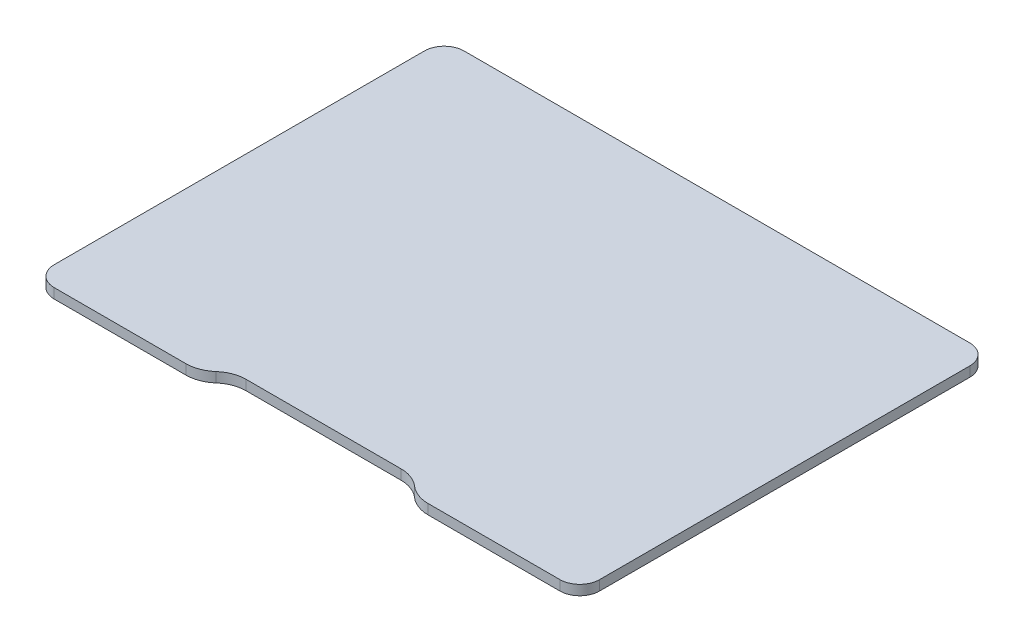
ISO-10303-21;
HEADER;
FILE_DESCRIPTION(('STEP AP214'),'2;1');
FILE_NAME('part.step','',(''),(''),'','','');
FILE_SCHEMA(('AUTOMOTIVE_DESIGN { 1 0 10303 214 1 1 1 1 }'));
ENDSEC;
DATA;
#1=APPLICATION_CONTEXT('core data for automotive mechanical design processes');
#2=APPLICATION_PROTOCOL_DEFINITION('international standard','automotive_design',2000,#1);
#3=PRODUCT_CONTEXT('',#1,'mechanical');
#4=PRODUCT('Part','Part','',(#3));
#5=PRODUCT_RELATED_PRODUCT_CATEGORY('part','',(#4));
#6=PRODUCT_DEFINITION_FORMATION('','',#4);
#7=PRODUCT_DEFINITION_CONTEXT('part definition',#1,'design');
#8=PRODUCT_DEFINITION('design','',#6,#7);
#9=PRODUCT_DEFINITION_SHAPE('','',#8);
#10=(LENGTH_UNIT() NAMED_UNIT(*) SI_UNIT(.MILLI.,.METRE.));
#11=(NAMED_UNIT(*) PLANE_ANGLE_UNIT() SI_UNIT($,.RADIAN.));
#12=(NAMED_UNIT(*) SI_UNIT($,.STERADIAN.) SOLID_ANGLE_UNIT());
#13=UNCERTAINTY_MEASURE_WITH_UNIT(LENGTH_MEASURE(1.E-05),#10,'distance_accuracy_value','');
#14=(GEOMETRIC_REPRESENTATION_CONTEXT(3) GLOBAL_UNCERTAINTY_ASSIGNED_CONTEXT((#13)) GLOBAL_UNIT_ASSIGNED_CONTEXT((#10,
#11,#12)) REPRESENTATION_CONTEXT('',''));
#15=CARTESIAN_POINT('',(0.,0.,0.));
#16=DIRECTION('',(0.,0.,1.));
#17=DIRECTION('',(1.,0.,0.));
#18=AXIS2_PLACEMENT_3D('',#15,#16,#17);
#19=CARTESIAN_POINT('',(-82.5,3.,62.));
#20=DIRECTION('',(1.,0.,0.));
#21=DIRECTION('',(0.,0.,-1.));
#22=AXIS2_PLACEMENT_3D('',#19,#20,#21);
#23=PLANE('',#22);
#24=DIRECTION('',(0.,0.,1.));
#25=VECTOR('',#24,1.);
#26=CARTESIAN_POINT('',(-82.5,3.,62.));
#27=LINE('',#26,#25);
#28=CARTESIAN_POINT('',(-82.5,3.,-56.));
#29=VERTEX_POINT('',#28);
#30=CARTESIAN_POINT('',(-82.5,3.,56.));
#31=VERTEX_POINT('',#30);
#32=EDGE_CURVE('E164',#29,#31,#27,.T.);
#33=ORIENTED_EDGE('',*,*,#32,.F.);
#34=DIRECTION('',(0.,-1.,0.));
#35=VECTOR('',#34,1.);
#36=CARTESIAN_POINT('',(-82.5,3.,-56.));
#37=LINE('',#36,#35);
#38=CARTESIAN_POINT('',(-82.5,0.,-56.));
#39=VERTEX_POINT('',#38);
#40=EDGE_CURVE('E148',#29,#39,#37,.T.);
#41=ORIENTED_EDGE('',*,*,#40,.T.);
#42=DIRECTION('',(0.,0.,1.));
#43=VECTOR('',#42,1.);
#44=CARTESIAN_POINT('',(-82.5,0.,62.));
#45=LINE('',#44,#43);
#46=CARTESIAN_POINT('',(-82.5,0.,56.));
#47=VERTEX_POINT('',#46);
#48=EDGE_CURVE('E161',#39,#47,#45,.T.);
#49=ORIENTED_EDGE('',*,*,#48,.T.);
#50=DIRECTION('',(0.,-1.,0.));
#51=VECTOR('',#50,1.);
#52=CARTESIAN_POINT('',(-82.5,3.,56.));
#53=LINE('',#52,#51);
#54=EDGE_CURVE('E167',#47,#31,#53,.F.);
#55=ORIENTED_EDGE('',*,*,#54,.T.);
#56=EDGE_LOOP('',(#33,#41,#49,#55));
#57=FACE_BOUND('',#56,.T.);
#58=ADVANCED_FACE('F43',(#57),#23,.F.);
#59=CARTESIAN_POINT('',(-32.5,3.,62.));
#60=DIRECTION('',(0.,0.,-1.));
#61=DIRECTION('',(-1.,0.,0.));
#62=AXIS2_PLACEMENT_3D('',#59,#60,#61);
#63=PLANE('',#62);
#64=DIRECTION('',(1.,0.,0.));
#65=VECTOR('',#64,1.);
#66=CARTESIAN_POINT('',(-32.5,0.,62.));
#67=LINE('',#66,#65);
#68=CARTESIAN_POINT('',(-76.5,0.,62.));
#69=VERTEX_POINT('',#68);
#70=CARTESIAN_POINT('',(-36.6421356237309,0.,62.));
#71=VERTEX_POINT('',#70);
#72=EDGE_CURVE('E174',#69,#71,#67,.T.);
#73=ORIENTED_EDGE('',*,*,#72,.T.);
#74=DIRECTION('',(0.,-1.,0.));
#75=VECTOR('',#74,1.);
#76=CARTESIAN_POINT('',(-36.6421356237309,3.,62.));
#77=LINE('',#76,#75);
#78=CARTESIAN_POINT('',(-36.6421356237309,3.,62.));
#79=VERTEX_POINT('',#78);
#80=EDGE_CURVE('E256',#71,#79,#77,.F.);
#81=ORIENTED_EDGE('',*,*,#80,.T.);
#82=DIRECTION('',(1.,0.,0.));
#83=VECTOR('',#82,1.);
#84=CARTESIAN_POINT('',(-32.5,3.,62.));
#85=LINE('',#84,#83);
#86=CARTESIAN_POINT('',(-76.5,3.,62.));
#87=VERTEX_POINT('',#86);
#88=EDGE_CURVE('E300',#87,#79,#85,.T.);
#89=ORIENTED_EDGE('',*,*,#88,.F.);
#90=DIRECTION('',(0.,-1.,0.));
#91=VECTOR('',#90,1.);
#92=CARTESIAN_POINT('',(-76.5,3.,62.));
#93=LINE('',#92,#91);
#94=EDGE_CURVE('E230',#87,#69,#93,.T.);
#95=ORIENTED_EDGE('',*,*,#94,.T.);
#96=EDGE_LOOP('',(#73,#81,#89,#95));
#97=FACE_BOUND('',#96,.T.);
#98=ADVANCED_FACE('F314',(#97),#63,.F.);
#99=CARTESIAN_POINT('',(-27.5,3.,57.));
#100=DIRECTION('',(0.,0.,-1.));
#101=DIRECTION('',(-1.,0.,0.));
#102=AXIS2_PLACEMENT_3D('',#99,#100,#101);
#103=PLANE('',#102);
#104=DIRECTION('',(1.,0.,0.));
#105=VECTOR('',#104,1.);
#106=CARTESIAN_POINT('',(-27.5,3.,57.));
#107=LINE('',#106,#105);
#108=CARTESIAN_POINT('',(-23.413379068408,3.,57.));
#109=VERTEX_POINT('',#108);
#110=CARTESIAN_POINT('',(23.413379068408,3.,57.));
#111=VERTEX_POINT('',#110);
#112=EDGE_CURVE('E295',#109,#111,#107,.T.);
#113=ORIENTED_EDGE('',*,*,#112,.F.);
#114=DIRECTION('',(0.,-1.,0.));
#115=VECTOR('',#114,1.);
#116=CARTESIAN_POINT('',(-23.413379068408,3.,57.));
#117=LINE('',#116,#115);
#118=CARTESIAN_POINT('',(-23.413379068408,0.,57.));
#119=VERTEX_POINT('',#118);
#120=EDGE_CURVE('E262',#109,#119,#117,.T.);
#121=ORIENTED_EDGE('',*,*,#120,.T.);
#122=DIRECTION('',(1.,0.,0.));
#123=VECTOR('',#122,1.);
#124=CARTESIAN_POINT('',(-27.5,0.,57.));
#125=LINE('',#124,#123);
#126=CARTESIAN_POINT('',(23.413379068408,0.,57.));
#127=VERTEX_POINT('',#126);
#128=EDGE_CURVE('E178',#119,#127,#125,.T.);
#129=ORIENTED_EDGE('',*,*,#128,.T.);
#130=DIRECTION('',(0.,-1.,0.));
#131=VECTOR('',#130,1.);
#132=CARTESIAN_POINT('',(23.413379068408,3.,57.));
#133=LINE('',#132,#131);
#134=EDGE_CURVE('E259',#127,#111,#133,.F.);
#135=ORIENTED_EDGE('',*,*,#134,.T.);
#136=EDGE_LOOP('',(#113,#121,#129,#135));
#137=FACE_BOUND('',#136,.T.);
#138=ADVANCED_FACE('F281',(#137),#103,.F.);
#139=CARTESIAN_POINT('',(82.5,3.,62.));
#140=DIRECTION('',(0.,0.,-1.));
#141=DIRECTION('',(-1.,0.,0.));
#142=AXIS2_PLACEMENT_3D('',#139,#140,#141);
#143=PLANE('',#142);
#144=DIRECTION('',(1.,0.,0.));
#145=VECTOR('',#144,1.);
#146=CARTESIAN_POINT('',(82.5,3.,62.));
#147=LINE('',#146,#145);
#148=CARTESIAN_POINT('',(36.6421356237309,3.,62.));
#149=VERTEX_POINT('',#148);
#150=CARTESIAN_POINT('',(76.5,3.,62.));
#151=VERTEX_POINT('',#150);
#152=EDGE_CURVE('E288',#149,#151,#147,.T.);
#153=ORIENTED_EDGE('',*,*,#152,.F.);
#154=DIRECTION('',(0.,-1.,0.));
#155=VECTOR('',#154,1.);
#156=CARTESIAN_POINT('',(36.6421356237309,3.,62.));
#157=LINE('',#156,#155);
#158=CARTESIAN_POINT('',(36.6421356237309,0.,62.));
#159=VERTEX_POINT('',#158);
#160=EDGE_CURVE('E238',#149,#159,#157,.T.);
#161=ORIENTED_EDGE('',*,*,#160,.T.);
#162=DIRECTION('',(1.,0.,0.));
#163=VECTOR('',#162,1.);
#164=CARTESIAN_POINT('',(82.5,0.,62.));
#165=LINE('',#164,#163);
#166=CARTESIAN_POINT('',(76.5,0.,62.));
#167=VERTEX_POINT('',#166);
#168=EDGE_CURVE('E187',#159,#167,#165,.T.);
#169=ORIENTED_EDGE('',*,*,#168,.T.);
#170=DIRECTION('',(0.,-1.,0.));
#171=VECTOR('',#170,1.);
#172=CARTESIAN_POINT('',(76.5,3.,62.));
#173=LINE('',#172,#171);
#174=EDGE_CURVE('E234',#167,#151,#173,.F.);
#175=ORIENTED_EDGE('',*,*,#174,.T.);
#176=EDGE_LOOP('',(#153,#161,#169,#175));
#177=FACE_BOUND('',#176,.T.);
#178=ADVANCED_FACE('F290',(#177),#143,.F.);
#179=CARTESIAN_POINT('',(82.5,3.,62.));
#180=DIRECTION('',(-1.,0.,0.));
#181=DIRECTION('',(0.,0.,1.));
#182=AXIS2_PLACEMENT_3D('',#179,#180,#181);
#183=PLANE('',#182);
#184=DIRECTION('',(0.,0.,-1.));
#185=VECTOR('',#184,1.);
#186=CARTESIAN_POINT('',(82.5,0.,62.));
#187=LINE('',#186,#185);
#188=CARTESIAN_POINT('',(82.5,0.,56.));
#189=VERTEX_POINT('',#188);
#190=CARTESIAN_POINT('',(82.5,0.,-56.));
#191=VERTEX_POINT('',#190);
#192=EDGE_CURVE('E190',#189,#191,#187,.T.);
#193=ORIENTED_EDGE('',*,*,#192,.T.);
#194=DIRECTION('',(0.,-1.,0.));
#195=VECTOR('',#194,1.);
#196=CARTESIAN_POINT('',(82.5,3.,-56.));
#197=LINE('',#196,#195);
#198=CARTESIAN_POINT('',(82.5,3.,-56.));
#199=VERTEX_POINT('',#198);
#200=EDGE_CURVE('E227',#191,#199,#197,.F.);
#201=ORIENTED_EDGE('',*,*,#200,.T.);
#202=DIRECTION('',(0.,0.,-1.));
#203=VECTOR('',#202,1.);
#204=CARTESIAN_POINT('',(82.5,3.,62.));
#205=LINE('',#204,#203);
#206=CARTESIAN_POINT('',(82.5,3.,56.));
#207=VERTEX_POINT('',#206);
#208=EDGE_CURVE('E294',#207,#199,#205,.T.);
#209=ORIENTED_EDGE('',*,*,#208,.F.);
#210=DIRECTION('',(0.,-1.,0.));
#211=VECTOR('',#210,1.);
#212=CARTESIAN_POINT('',(82.5,3.,56.));
#213=LINE('',#212,#211);
#214=EDGE_CURVE('E223',#207,#189,#213,.T.);
#215=ORIENTED_EDGE('',*,*,#214,.T.);
#216=EDGE_LOOP('',(#193,#201,#209,#215));
#217=FACE_BOUND('',#216,.T.);
#218=ADVANCED_FACE('F428',(#217),#183,.F.);
#219=CARTESIAN_POINT('',(82.5,3.,-62.));
#220=DIRECTION('',(0.,0.,1.));
#221=DIRECTION('',(1.,0.,0.));
#222=AXIS2_PLACEMENT_3D('',#219,#220,#221);
#223=PLANE('',#222);
#224=DIRECTION('',(-1.,0.,0.));
#225=VECTOR('',#224,1.);
#226=CARTESIAN_POINT('',(82.5,0.,-62.));
#227=LINE('',#226,#225);
#228=CARTESIAN_POINT('',(76.5,0.,-62.));
#229=VERTEX_POINT('',#228);
#230=CARTESIAN_POINT('',(-76.5,0.,-62.));
#231=VERTEX_POINT('',#230);
#232=EDGE_CURVE('E194',#229,#231,#227,.T.);
#233=ORIENTED_EDGE('',*,*,#232,.T.);
#234=DIRECTION('',(0.,-1.,0.));
#235=VECTOR('',#234,1.);
#236=CARTESIAN_POINT('',(-76.5,3.,-62.));
#237=LINE('',#236,#235);
#238=CARTESIAN_POINT('',(-76.5,3.,-62.));
#239=VERTEX_POINT('',#238);
#240=EDGE_CURVE('E149',#231,#239,#237,.F.);
#241=ORIENTED_EDGE('',*,*,#240,.T.);
#242=DIRECTION('',(-1.,0.,0.));
#243=VECTOR('',#242,1.);
#244=CARTESIAN_POINT('',(82.5,3.,-62.));
#245=LINE('',#244,#243);
#246=CARTESIAN_POINT('',(76.5,3.,-62.));
#247=VERTEX_POINT('',#246);
#248=EDGE_CURVE('E181',#247,#239,#245,.T.);
#249=ORIENTED_EDGE('',*,*,#248,.F.);
#250=DIRECTION('',(0.,-1.,0.));
#251=VECTOR('',#250,1.);
#252=CARTESIAN_POINT('',(76.5,3.,-62.));
#253=LINE('',#252,#251);
#254=EDGE_CURVE('E155',#247,#229,#253,.T.);
#255=ORIENTED_EDGE('',*,*,#254,.T.);
#256=EDGE_LOOP('',(#233,#241,#249,#255));
#257=FACE_BOUND('',#256,.T.);
#258=ADVANCED_FACE('F419',(#257),#223,.F.);
#259=CARTESIAN_POINT('',(0.,3.,0.));
#260=DIRECTION('',(0.,1.,0.));
#261=DIRECTION('',(0.,0.,1.));
#262=AXIS2_PLACEMENT_3D('',#259,#260,#261);
#263=PLANE('',#262);
#264=ORIENTED_EDGE('',*,*,#112,.T.);
#265=CARTESIAN_POINT('',(23.413379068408,3.,67.));
#266=DIRECTION('',(0.,1.,0.));
#267=DIRECTION('',(0.,0.,1.));
#268=AXIS2_PLACEMENT_3D('',#265,#266,#267);
#269=CIRCLE('',#268,10.);
#270=CARTESIAN_POINT('',(30.0277573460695,3.,59.5));
#271=VERTEX_POINT('',#270);
#272=EDGE_CURVE('E11',#111,#271,#269,.F.);
#273=ORIENTED_EDGE('',*,*,#272,.T.);
#274=CARTESIAN_POINT('',(36.6421356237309,3.,52.));
#275=DIRECTION('',(0.,1.,0.));
#276=DIRECTION('',(0.,0.,1.));
#277=AXIS2_PLACEMENT_3D('',#274,#275,#276);
#278=CIRCLE('',#277,10.);
#279=EDGE_CURVE('E253',#271,#149,#278,.T.);
#280=ORIENTED_EDGE('',*,*,#279,.T.);
#281=ORIENTED_EDGE('',*,*,#152,.T.);
#282=CARTESIAN_POINT('',(76.5,3.,56.));
#283=DIRECTION('',(0.,1.,0.));
#284=DIRECTION('',(0.,0.,1.));
#285=AXIS2_PLACEMENT_3D('',#282,#283,#284);
#286=CIRCLE('',#285,6.);
#287=EDGE_CURVE('E211',#151,#207,#286,.T.);
#288=ORIENTED_EDGE('',*,*,#287,.T.);
#289=ORIENTED_EDGE('',*,*,#208,.T.);
#290=CARTESIAN_POINT('',(76.5,3.,-56.));
#291=DIRECTION('',(0.,1.,0.));
#292=DIRECTION('',(0.,0.,1.));
#293=AXIS2_PLACEMENT_3D('',#290,#291,#292);
#294=CIRCLE('',#293,6.);
#295=EDGE_CURVE('E217',#199,#247,#294,.T.);
#296=ORIENTED_EDGE('',*,*,#295,.T.);
#297=ORIENTED_EDGE('',*,*,#248,.T.);
#298=CARTESIAN_POINT('',(-76.5,3.,-56.));
#299=DIRECTION('',(0.,1.,0.));
#300=DIRECTION('',(0.,0.,1.));
#301=AXIS2_PLACEMENT_3D('',#298,#299,#300);
#302=CIRCLE('',#301,6.);
#303=EDGE_CURVE('E220',#239,#29,#302,.T.);
#304=ORIENTED_EDGE('',*,*,#303,.T.);
#305=ORIENTED_EDGE('',*,*,#32,.T.);
#306=CARTESIAN_POINT('',(-76.5,3.,56.));
#307=DIRECTION('',(0.,1.,0.));
#308=DIRECTION('',(0.,0.,1.));
#309=AXIS2_PLACEMENT_3D('',#306,#307,#308);
#310=CIRCLE('',#309,6.);
#311=EDGE_CURVE('E214',#31,#87,#310,.T.);
#312=ORIENTED_EDGE('',*,*,#311,.T.);
#313=ORIENTED_EDGE('',*,*,#88,.T.);
#314=CARTESIAN_POINT('',(-36.6421356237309,3.,52.));
#315=DIRECTION('',(0.,1.,0.));
#316=DIRECTION('',(0.,0.,1.));
#317=AXIS2_PLACEMENT_3D('',#314,#315,#316);
#318=CIRCLE('',#317,10.);
#319=CARTESIAN_POINT('',(-30.0277573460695,3.,59.5));
#320=VERTEX_POINT('',#319);
#321=EDGE_CURVE('E249',#79,#320,#318,.T.);
#322=ORIENTED_EDGE('',*,*,#321,.T.);
#323=CARTESIAN_POINT('',(-23.413379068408,3.,67.));
#324=DIRECTION('',(0.,1.,0.));
#325=DIRECTION('',(0.,0.,1.));
#326=AXIS2_PLACEMENT_3D('',#323,#324,#325);
#327=CIRCLE('',#326,10.);
#328=EDGE_CURVE('E275',#320,#109,#327,.F.);
#329=ORIENTED_EDGE('',*,*,#328,.T.);
#330=EDGE_LOOP('',(#264,#273,#280,#281,#288,#289,#296,#297,#304,#305,#312,#313,#322,#329));
#331=FACE_BOUND('',#330,.T.);
#332=ADVANCED_FACE('F287',(#331),#263,.T.);
#333=CARTESIAN_POINT('',(0.,0.,0.));
#334=DIRECTION('',(0.,1.,0.));
#335=DIRECTION('',(0.,0.,1.));
#336=AXIS2_PLACEMENT_3D('',#333,#334,#335);
#337=PLANE('',#336);
#338=ORIENTED_EDGE('',*,*,#168,.F.);
#339=CARTESIAN_POINT('',(36.6421356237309,0.,52.));
#340=DIRECTION('',(0.,1.,0.));
#341=DIRECTION('',(0.,0.,1.));
#342=AXIS2_PLACEMENT_3D('',#339,#340,#341);
#343=CIRCLE('',#342,10.);
#344=CARTESIAN_POINT('',(30.0277573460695,0.,59.5));
#345=VERTEX_POINT('',#344);
#346=EDGE_CURVE('E245',#159,#345,#343,.F.);
#347=ORIENTED_EDGE('',*,*,#346,.T.);
#348=CARTESIAN_POINT('',(23.413379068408,0.,67.));
#349=DIRECTION('',(0.,1.,0.));
#350=DIRECTION('',(0.,0.,1.));
#351=AXIS2_PLACEMENT_3D('',#348,#349,#350);
#352=CIRCLE('',#351,10.);
#353=EDGE_CURVE('E52',#345,#127,#352,.T.);
#354=ORIENTED_EDGE('',*,*,#353,.T.);
#355=ORIENTED_EDGE('',*,*,#128,.F.);
#356=CARTESIAN_POINT('',(-23.413379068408,0.,67.));
#357=DIRECTION('',(0.,1.,0.));
#358=DIRECTION('',(0.,0.,1.));
#359=AXIS2_PLACEMENT_3D('',#356,#357,#358);
#360=CIRCLE('',#359,10.);
#361=CARTESIAN_POINT('',(-30.0277573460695,0.,59.5));
#362=VERTEX_POINT('',#361);
#363=EDGE_CURVE('E272',#119,#362,#360,.T.);
#364=ORIENTED_EDGE('',*,*,#363,.T.);
#365=CARTESIAN_POINT('',(-36.6421356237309,0.,52.));
#366=DIRECTION('',(0.,1.,0.));
#367=DIRECTION('',(0.,0.,1.));
#368=AXIS2_PLACEMENT_3D('',#365,#366,#367);
#369=CIRCLE('',#368,10.);
#370=EDGE_CURVE('E242',#362,#71,#369,.F.);
#371=ORIENTED_EDGE('',*,*,#370,.T.);
#372=ORIENTED_EDGE('',*,*,#72,.F.);
#373=CARTESIAN_POINT('',(-76.5,0.,56.));
#374=DIRECTION('',(0.,1.,0.));
#375=DIRECTION('',(0.,0.,1.));
#376=AXIS2_PLACEMENT_3D('',#373,#374,#375);
#377=CIRCLE('',#376,6.);
#378=EDGE_CURVE('E172',#69,#47,#377,.F.);
#379=ORIENTED_EDGE('',*,*,#378,.T.);
#380=ORIENTED_EDGE('',*,*,#48,.F.);
#381=CARTESIAN_POINT('',(-76.5,0.,-56.));
#382=DIRECTION('',(0.,1.,0.));
#383=DIRECTION('',(0.,0.,1.));
#384=AXIS2_PLACEMENT_3D('',#381,#382,#383);
#385=CIRCLE('',#384,6.);
#386=EDGE_CURVE('E144',#39,#231,#385,.F.);
#387=ORIENTED_EDGE('',*,*,#386,.T.);
#388=ORIENTED_EDGE('',*,*,#232,.F.);
#389=CARTESIAN_POINT('',(76.5,0.,-56.));
#390=DIRECTION('',(0.,1.,0.));
#391=DIRECTION('',(0.,0.,1.));
#392=AXIS2_PLACEMENT_3D('',#389,#390,#391);
#393=CIRCLE('',#392,6.);
#394=EDGE_CURVE('E156',#229,#191,#393,.F.);
#395=ORIENTED_EDGE('',*,*,#394,.T.);
#396=ORIENTED_EDGE('',*,*,#192,.F.);
#397=CARTESIAN_POINT('',(76.5,0.,56.));
#398=DIRECTION('',(0.,1.,0.));
#399=DIRECTION('',(0.,0.,1.));
#400=AXIS2_PLACEMENT_3D('',#397,#398,#399);
#401=CIRCLE('',#400,6.);
#402=EDGE_CURVE('E166',#189,#167,#401,.F.);
#403=ORIENTED_EDGE('',*,*,#402,.T.);
#404=EDGE_LOOP('',(#338,#347,#354,#355,#364,#371,#372,#379,#380,#387,#388,#395,#396,#403));
#405=FACE_BOUND('',#404,.T.);
#406=ADVANCED_FACE('F170',(#405),#337,.F.);
#407=CARTESIAN_POINT('',(-76.5,3.,-56.));
#408=DIRECTION('',(0.,-1.,0.));
#409=DIRECTION('',(0.,0.,-1.));
#410=AXIS2_PLACEMENT_3D('',#407,#408,#409);
#411=CYLINDRICAL_SURFACE('',#410,6.);
#412=ORIENTED_EDGE('',*,*,#303,.F.);
#413=ORIENTED_EDGE('',*,*,#240,.F.);
#414=ORIENTED_EDGE('',*,*,#386,.F.);
#415=ORIENTED_EDGE('',*,*,#40,.F.);
#416=EDGE_LOOP('',(#412,#413,#414,#415));
#417=FACE_BOUND('',#416,.T.);
#418=ADVANCED_FACE('F147',(#417),#411,.T.);
#419=CARTESIAN_POINT('',(76.5,3.,-56.));
#420=DIRECTION('',(0.,-1.,0.));
#421=DIRECTION('',(0.,0.,-1.));
#422=AXIS2_PLACEMENT_3D('',#419,#420,#421);
#423=CYLINDRICAL_SURFACE('',#422,6.);
#424=ORIENTED_EDGE('',*,*,#295,.F.);
#425=ORIENTED_EDGE('',*,*,#200,.F.);
#426=ORIENTED_EDGE('',*,*,#394,.F.);
#427=ORIENTED_EDGE('',*,*,#254,.F.);
#428=EDGE_LOOP('',(#424,#425,#426,#427));
#429=FACE_BOUND('',#428,.T.);
#430=ADVANCED_FACE('F340',(#429),#423,.T.);
#431=CARTESIAN_POINT('',(-76.5,3.,56.));
#432=DIRECTION('',(0.,-1.,0.));
#433=DIRECTION('',(0.,0.,-1.));
#434=AXIS2_PLACEMENT_3D('',#431,#432,#433);
#435=CYLINDRICAL_SURFACE('',#434,6.);
#436=ORIENTED_EDGE('',*,*,#311,.F.);
#437=ORIENTED_EDGE('',*,*,#54,.F.);
#438=ORIENTED_EDGE('',*,*,#378,.F.);
#439=ORIENTED_EDGE('',*,*,#94,.F.);
#440=EDGE_LOOP('',(#436,#437,#438,#439));
#441=FACE_BOUND('',#440,.T.);
#442=ADVANCED_FACE('F312',(#441),#435,.T.);
#443=CARTESIAN_POINT('',(76.5,3.,56.));
#444=DIRECTION('',(0.,-1.,0.));
#445=DIRECTION('',(0.,0.,-1.));
#446=AXIS2_PLACEMENT_3D('',#443,#444,#445);
#447=CYLINDRICAL_SURFACE('',#446,6.);
#448=ORIENTED_EDGE('',*,*,#287,.F.);
#449=ORIENTED_EDGE('',*,*,#174,.F.);
#450=ORIENTED_EDGE('',*,*,#402,.F.);
#451=ORIENTED_EDGE('',*,*,#214,.F.);
#452=EDGE_LOOP('',(#448,#449,#450,#451));
#453=FACE_BOUND('',#452,.T.);
#454=ADVANCED_FACE('F346',(#453),#447,.T.);
#455=CARTESIAN_POINT('',(36.6421356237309,3.,52.));
#456=DIRECTION('',(0.,-1.,0.));
#457=DIRECTION('',(0.,0.,-1.));
#458=AXIS2_PLACEMENT_3D('',#455,#456,#457);
#459=CYLINDRICAL_SURFACE('',#458,10.);
#460=ORIENTED_EDGE('',*,*,#279,.F.);
#461=DIRECTION('',(0.,-1.,0.));
#462=VECTOR('',#461,1.);
#463=CARTESIAN_POINT('',(30.0277573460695,3.,59.5));
#464=LINE('',#463,#462);
#465=EDGE_CURVE('E269',#271,#345,#464,.T.);
#466=ORIENTED_EDGE('',*,*,#465,.T.);
#467=ORIENTED_EDGE('',*,*,#346,.F.);
#468=ORIENTED_EDGE('',*,*,#160,.F.);
#469=EDGE_LOOP('',(#460,#466,#467,#468));
#470=FACE_BOUND('',#469,.T.);
#471=ADVANCED_FACE('F284',(#470),#459,.T.);
#472=CARTESIAN_POINT('',(-36.6421356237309,3.,52.));
#473=DIRECTION('',(0.,-1.,0.));
#474=DIRECTION('',(0.,0.,-1.));
#475=AXIS2_PLACEMENT_3D('',#472,#473,#474);
#476=CYLINDRICAL_SURFACE('',#475,10.);
#477=ORIENTED_EDGE('',*,*,#370,.F.);
#478=DIRECTION('',(0.,-1.,0.));
#479=VECTOR('',#478,1.);
#480=CARTESIAN_POINT('',(-30.0277573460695,3.,59.5));
#481=LINE('',#480,#479);
#482=EDGE_CURVE('E266',#362,#320,#481,.F.);
#483=ORIENTED_EDGE('',*,*,#482,.T.);
#484=ORIENTED_EDGE('',*,*,#321,.F.);
#485=ORIENTED_EDGE('',*,*,#80,.F.);
#486=EDGE_LOOP('',(#477,#483,#484,#485));
#487=FACE_BOUND('',#486,.T.);
#488=ADVANCED_FACE('F319',(#487),#476,.T.);
#489=CARTESIAN_POINT('',(-23.413379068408,3.,67.));
#490=DIRECTION('',(0.,-1.,0.));
#491=DIRECTION('',(0.,0.,-1.));
#492=AXIS2_PLACEMENT_3D('',#489,#490,#491);
#493=CYLINDRICAL_SURFACE('',#492,10.);
#494=ORIENTED_EDGE('',*,*,#328,.F.);
#495=ORIENTED_EDGE('',*,*,#482,.F.);
#496=ORIENTED_EDGE('',*,*,#363,.F.);
#497=ORIENTED_EDGE('',*,*,#120,.F.);
#498=EDGE_LOOP('',(#494,#495,#496,#497));
#499=FACE_BOUND('',#498,.T.);
#500=ADVANCED_FACE('F323',(#499),#493,.F.);
#501=CARTESIAN_POINT('',(23.413379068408,3.,67.));
#502=DIRECTION('',(0.,-1.,0.));
#503=DIRECTION('',(0.,0.,-1.));
#504=AXIS2_PLACEMENT_3D('',#501,#502,#503);
#505=CYLINDRICAL_SURFACE('',#504,10.);
#506=ORIENTED_EDGE('',*,*,#272,.F.);
#507=ORIENTED_EDGE('',*,*,#134,.F.);
#508=ORIENTED_EDGE('',*,*,#353,.F.);
#509=ORIENTED_EDGE('',*,*,#465,.F.);
#510=EDGE_LOOP('',(#506,#507,#508,#509));
#511=FACE_BOUND('',#510,.T.);
#512=ADVANCED_FACE('F45',(#511),#505,.F.);
#513=CLOSED_SHELL('',(#58,#98,#138,#178,#218,#258,#332,#406,#418,#430,#442,#454,#471,#488,#500,#512));
#514=MANIFOLD_SOLID_BREP('B2',#513);
#515=ADVANCED_BREP_SHAPE_REPRESENTATION('',(#18,#514),#14);
#516=SHAPE_DEFINITION_REPRESENTATION(#9,#515);
ENDSEC;
END-ISO-10303-21;
